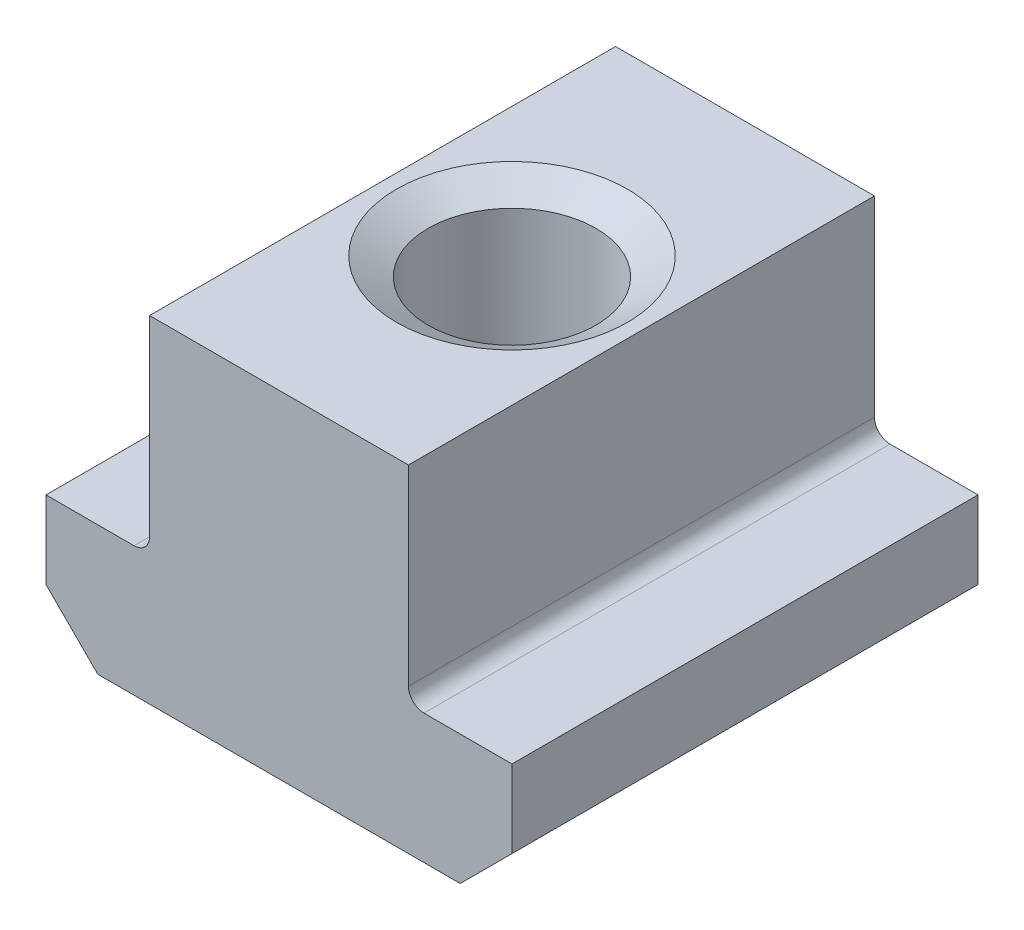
ISO-10303-21;
HEADER;
FILE_DESCRIPTION(('STEP AP214'),'2;1');
FILE_NAME('part.step','',(''),(''),'','','');
FILE_SCHEMA(('AUTOMOTIVE_DESIGN { 1 0 10303 214 1 1 1 1 }'));
ENDSEC;
DATA;
#1=APPLICATION_CONTEXT('core data for automotive mechanical design processes');
#2=APPLICATION_PROTOCOL_DEFINITION('international standard','automotive_design',2000,#1);
#3=PRODUCT_CONTEXT('',#1,'mechanical');
#4=PRODUCT('Part','Part','',(#3));
#5=PRODUCT_RELATED_PRODUCT_CATEGORY('part','',(#4));
#6=PRODUCT_DEFINITION_FORMATION('','',#4);
#7=PRODUCT_DEFINITION_CONTEXT('part definition',#1,'design');
#8=PRODUCT_DEFINITION('design','',#6,#7);
#9=PRODUCT_DEFINITION_SHAPE('','',#8);
#10=(LENGTH_UNIT() NAMED_UNIT(*) SI_UNIT(.MILLI.,.METRE.));
#11=(NAMED_UNIT(*) PLANE_ANGLE_UNIT() SI_UNIT($,.RADIAN.));
#12=(NAMED_UNIT(*) SI_UNIT($,.STERADIAN.) SOLID_ANGLE_UNIT());
#13=UNCERTAINTY_MEASURE_WITH_UNIT(LENGTH_MEASURE(1.E-05),#10,'distance_accuracy_value','');
#14=(GEOMETRIC_REPRESENTATION_CONTEXT(3) GLOBAL_UNCERTAINTY_ASSIGNED_CONTEXT((#13)) GLOBAL_UNIT_ASSIGNED_CONTEXT((#10,
#11,#12)) REPRESENTATION_CONTEXT('',''));
#15=CARTESIAN_POINT('',(0.,0.,0.));
#16=DIRECTION('',(0.,0.,1.));
#17=DIRECTION('',(1.,0.,0.));
#18=AXIS2_PLACEMENT_3D('',#15,#16,#17);
#19=CARTESIAN_POINT('',(-4.5,0.,-9.));
#20=DIRECTION('',(-1.,0.,0.));
#21=DIRECTION('',(0.,0.,1.));
#22=AXIS2_PLACEMENT_3D('',#19,#20,#21);
#23=PLANE('',#22);
#24=DIRECTION('',(0.,-1.,0.));
#25=VECTOR('',#24,1.);
#26=CARTESIAN_POINT('',(-4.5,0.,-9.));
#27=LINE('',#26,#25);
#28=CARTESIAN_POINT('',(-4.5,2.5,-9.));
#29=VERTEX_POINT('',#28);
#30=CARTESIAN_POINT('',(-4.5,1.00000000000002,-9.));
#31=VERTEX_POINT('',#30);
#32=EDGE_CURVE('E191',#29,#31,#27,.T.);
#33=ORIENTED_EDGE('',*,*,#32,.T.);
#34=DIRECTION('',(0.,0.,1.));
#35=VECTOR('',#34,1.);
#36=CARTESIAN_POINT('',(-4.5,1.00000000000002,-9.));
#37=LINE('',#36,#35);
#38=CARTESIAN_POINT('',(-4.5,1.00000000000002,0.));
#39=VERTEX_POINT('',#38);
#40=EDGE_CURVE('E218',#31,#39,#37,.T.);
#41=ORIENTED_EDGE('',*,*,#40,.T.);
#42=DIRECTION('',(0.,-1.,0.));
#43=VECTOR('',#42,1.);
#44=CARTESIAN_POINT('',(-4.5,0.,0.));
#45=LINE('',#44,#43);
#46=CARTESIAN_POINT('',(-4.5,2.5,0.));
#47=VERTEX_POINT('',#46);
#48=EDGE_CURVE('E164',#47,#39,#45,.T.);
#49=ORIENTED_EDGE('',*,*,#48,.F.);
#50=DIRECTION('',(0.,0.,1.));
#51=VECTOR('',#50,1.);
#52=CARTESIAN_POINT('',(-4.5,2.5,-9.));
#53=LINE('',#52,#51);
#54=EDGE_CURVE('E192',#29,#47,#53,.T.);
#55=ORIENTED_EDGE('',*,*,#54,.F.);
#56=EDGE_LOOP('',(#33,#41,#49,#55));
#57=FACE_BOUND('',#56,.T.);
#58=ADVANCED_FACE('F33',(#57),#23,.T.);
#59=CARTESIAN_POINT('',(-4.5,2.5,-9.));
#60=DIRECTION('',(0.,1.,0.));
#61=DIRECTION('',(-1.,0.,0.));
#62=AXIS2_PLACEMENT_3D('',#59,#60,#61);
#63=PLANE('',#62);
#64=DIRECTION('',(-1.,0.,0.));
#65=VECTOR('',#64,1.);
#66=CARTESIAN_POINT('',(-4.5,2.5,0.));
#67=LINE('',#66,#65);
#68=CARTESIAN_POINT('',(-2.8,2.5,0.));
#69=VERTEX_POINT('',#68);
#70=EDGE_CURVE('E188',#69,#47,#67,.T.);
#71=ORIENTED_EDGE('',*,*,#70,.F.);
#72=DIRECTION('',(0.,0.,1.));
#73=VECTOR('',#72,1.);
#74=CARTESIAN_POINT('',(-2.8,2.5,-9.));
#75=LINE('',#74,#73);
#76=CARTESIAN_POINT('',(-2.8,2.5,-9.));
#77=VERTEX_POINT('',#76);
#78=EDGE_CURVE('E195',#77,#69,#75,.T.);
#79=ORIENTED_EDGE('',*,*,#78,.F.);
#80=DIRECTION('',(-1.,0.,0.));
#81=VECTOR('',#80,1.);
#82=CARTESIAN_POINT('',(-4.5,2.5,-9.));
#83=LINE('',#82,#81);
#84=EDGE_CURVE('E139',#77,#29,#83,.T.);
#85=ORIENTED_EDGE('',*,*,#84,.T.);
#86=ORIENTED_EDGE('',*,*,#54,.T.);
#87=EDGE_LOOP('',(#71,#79,#85,#86));
#88=FACE_BOUND('',#87,.T.);
#89=ADVANCED_FACE('F267',(#88),#63,.T.);
#90=CARTESIAN_POINT('',(-2.8,2.8,-9.));
#91=DIRECTION('',(0.,0.,1.));
#92=DIRECTION('',(1.,0.,0.));
#93=AXIS2_PLACEMENT_3D('',#90,#91,#92);
#94=CYLINDRICAL_SURFACE('',#93,0.3);
#95=CARTESIAN_POINT('',(-2.8,2.8,0.));
#96=DIRECTION('',(0.,0.,-1.));
#97=DIRECTION('',(-1.,0.,0.));
#98=AXIS2_PLACEMENT_3D('',#95,#96,#97);
#99=CIRCLE('',#98,0.3);
#100=CARTESIAN_POINT('',(-2.5,2.8,0.));
#101=VERTEX_POINT('',#100);
#102=EDGE_CURVE('E185',#101,#69,#99,.T.);
#103=ORIENTED_EDGE('',*,*,#102,.F.);
#104=DIRECTION('',(0.,0.,1.));
#105=VECTOR('',#104,1.);
#106=CARTESIAN_POINT('',(-2.5,2.8,-9.));
#107=LINE('',#106,#105);
#108=CARTESIAN_POINT('',(-2.5,2.8,-9.));
#109=VERTEX_POINT('',#108);
#110=EDGE_CURVE('E197',#109,#101,#107,.T.);
#111=ORIENTED_EDGE('',*,*,#110,.F.);
#112=CARTESIAN_POINT('',(-2.8,2.8,-9.));
#113=DIRECTION('',(0.,0.,-1.));
#114=DIRECTION('',(-1.,0.,0.));
#115=AXIS2_PLACEMENT_3D('',#112,#113,#114);
#116=CIRCLE('',#115,0.3);
#117=EDGE_CURVE('E159',#109,#77,#116,.T.);
#118=ORIENTED_EDGE('',*,*,#117,.T.);
#119=ORIENTED_EDGE('',*,*,#78,.T.);
#120=EDGE_LOOP('',(#103,#111,#118,#119));
#121=FACE_BOUND('',#120,.T.);
#122=ADVANCED_FACE('F297',(#121),#94,.F.);
#123=CARTESIAN_POINT('',(-2.5,2.8,-9.));
#124=DIRECTION('',(-1.,0.,0.));
#125=DIRECTION('',(0.,0.,1.));
#126=AXIS2_PLACEMENT_3D('',#123,#124,#125);
#127=PLANE('',#126);
#128=DIRECTION('',(0.,-1.,0.));
#129=VECTOR('',#128,1.);
#130=CARTESIAN_POINT('',(-2.5,2.8,0.));
#131=LINE('',#130,#129);
#132=CARTESIAN_POINT('',(-2.5,6.5,0.));
#133=VERTEX_POINT('',#132);
#134=EDGE_CURVE('E182',#133,#101,#131,.T.);
#135=ORIENTED_EDGE('',*,*,#134,.F.);
#136=DIRECTION('',(0.,0.,1.));
#137=VECTOR('',#136,1.);
#138=CARTESIAN_POINT('',(-2.5,6.5,-9.));
#139=LINE('',#138,#137);
#140=CARTESIAN_POINT('',(-2.5,6.5,-9.));
#141=VERTEX_POINT('',#140);
#142=EDGE_CURVE('E199',#141,#133,#139,.T.);
#143=ORIENTED_EDGE('',*,*,#142,.F.);
#144=DIRECTION('',(0.,-1.,0.));
#145=VECTOR('',#144,1.);
#146=CARTESIAN_POINT('',(-2.5,2.8,-9.));
#147=LINE('',#146,#145);
#148=EDGE_CURVE('E156',#141,#109,#147,.T.);
#149=ORIENTED_EDGE('',*,*,#148,.T.);
#150=ORIENTED_EDGE('',*,*,#110,.T.);
#151=EDGE_LOOP('',(#135,#143,#149,#150));
#152=FACE_BOUND('',#151,.T.);
#153=ADVANCED_FACE('F276',(#152),#127,.T.);
#154=CARTESIAN_POINT('',(-2.5,6.5,-9.));
#155=DIRECTION('',(0.,1.,0.));
#156=DIRECTION('',(0.,0.,1.));
#157=AXIS2_PLACEMENT_3D('',#154,#155,#156);
#158=PLANE('',#157);
#159=CARTESIAN_POINT('',(0.,6.5,-4.5));
#160=DIRECTION('',(0.,1.,0.));
#161=DIRECTION('',(0.,0.,1.));
#162=AXIS2_PLACEMENT_3D('',#159,#160,#161);
#163=CIRCLE('',#162,2.22998906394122);
#164=CARTESIAN_POINT('',(0.,6.5,-2.27001093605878));
#165=VERTEX_POINT('',#164);
#166=EDGE_CURVE('E41',#165,#165,#163,.F.);
#167=ORIENTED_EDGE('',*,*,#166,.T.);
#168=EDGE_LOOP('',(#167));
#169=FACE_BOUND('',#168,.T.);
#170=DIRECTION('',(-1.,0.,0.));
#171=VECTOR('',#170,1.);
#172=CARTESIAN_POINT('',(-2.5,6.5,0.));
#173=LINE('',#172,#171);
#174=CARTESIAN_POINT('',(2.5,6.5,0.));
#175=VERTEX_POINT('',#174);
#176=EDGE_CURVE('E179',#175,#133,#173,.T.);
#177=ORIENTED_EDGE('',*,*,#176,.F.);
#178=DIRECTION('',(0.,0.,1.));
#179=VECTOR('',#178,1.);
#180=CARTESIAN_POINT('',(2.5,6.5,-9.));
#181=LINE('',#180,#179);
#182=CARTESIAN_POINT('',(2.5,6.5,-9.));
#183=VERTEX_POINT('',#182);
#184=EDGE_CURVE('E201',#183,#175,#181,.T.);
#185=ORIENTED_EDGE('',*,*,#184,.F.);
#186=DIRECTION('',(-1.,0.,0.));
#187=VECTOR('',#186,1.);
#188=CARTESIAN_POINT('',(-2.5,6.5,-9.));
#189=LINE('',#188,#187);
#190=EDGE_CURVE('E153',#183,#141,#189,.T.);
#191=ORIENTED_EDGE('',*,*,#190,.T.);
#192=ORIENTED_EDGE('',*,*,#142,.T.);
#193=EDGE_LOOP('',(#177,#185,#191,#192));
#194=FACE_BOUND('',#193,.T.);
#195=ADVANCED_FACE('F229',(#169,#194),#158,.T.);
#196=CARTESIAN_POINT('',(2.5,2.8,-9.));
#197=DIRECTION('',(1.,0.,0.));
#198=DIRECTION('',(0.,1.,0.));
#199=AXIS2_PLACEMENT_3D('',#196,#197,#198);
#200=PLANE('',#199);
#201=DIRECTION('',(0.,1.,0.));
#202=VECTOR('',#201,1.);
#203=CARTESIAN_POINT('',(2.5,2.8,0.));
#204=LINE('',#203,#202);
#205=CARTESIAN_POINT('',(2.5,2.8,0.));
#206=VERTEX_POINT('',#205);
#207=EDGE_CURVE('E176',#206,#175,#204,.T.);
#208=ORIENTED_EDGE('',*,*,#207,.F.);
#209=DIRECTION('',(0.,0.,1.));
#210=VECTOR('',#209,1.);
#211=CARTESIAN_POINT('',(2.5,2.8,-9.));
#212=LINE('',#211,#210);
#213=CARTESIAN_POINT('',(2.5,2.8,-9.));
#214=VERTEX_POINT('',#213);
#215=EDGE_CURVE('E203',#214,#206,#212,.T.);
#216=ORIENTED_EDGE('',*,*,#215,.F.);
#217=DIRECTION('',(0.,1.,0.));
#218=VECTOR('',#217,1.);
#219=CARTESIAN_POINT('',(2.5,2.8,-9.));
#220=LINE('',#219,#218);
#221=EDGE_CURVE('E147',#214,#183,#220,.T.);
#222=ORIENTED_EDGE('',*,*,#221,.T.);
#223=ORIENTED_EDGE('',*,*,#184,.T.);
#224=EDGE_LOOP('',(#208,#216,#222,#223));
#225=FACE_BOUND('',#224,.T.);
#226=ADVANCED_FACE('F280',(#225),#200,.T.);
#227=CARTESIAN_POINT('',(2.8,2.8,-9.));
#228=DIRECTION('',(0.,0.,1.));
#229=DIRECTION('',(1.,0.,0.));
#230=AXIS2_PLACEMENT_3D('',#227,#228,#229);
#231=CYLINDRICAL_SURFACE('',#230,0.3);
#232=CARTESIAN_POINT('',(2.8,2.8,0.));
#233=DIRECTION('',(0.,0.,-1.));
#234=DIRECTION('',(1.,0.,0.));
#235=AXIS2_PLACEMENT_3D('',#232,#233,#234);
#236=CIRCLE('',#235,0.3);
#237=CARTESIAN_POINT('',(2.8,2.5,0.));
#238=VERTEX_POINT('',#237);
#239=EDGE_CURVE('E173',#238,#206,#236,.T.);
#240=ORIENTED_EDGE('',*,*,#239,.F.);
#241=DIRECTION('',(0.,0.,1.));
#242=VECTOR('',#241,1.);
#243=CARTESIAN_POINT('',(2.8,2.5,-9.));
#244=LINE('',#243,#242);
#245=CARTESIAN_POINT('',(2.8,2.5,-9.));
#246=VERTEX_POINT('',#245);
#247=EDGE_CURVE('E138',#246,#238,#244,.T.);
#248=ORIENTED_EDGE('',*,*,#247,.F.);
#249=CARTESIAN_POINT('',(2.8,2.8,-9.));
#250=DIRECTION('',(0.,0.,-1.));
#251=DIRECTION('',(1.,0.,0.));
#252=AXIS2_PLACEMENT_3D('',#249,#250,#251);
#253=CIRCLE('',#252,0.3);
#254=EDGE_CURVE('E145',#246,#214,#253,.T.);
#255=ORIENTED_EDGE('',*,*,#254,.T.);
#256=ORIENTED_EDGE('',*,*,#215,.T.);
#257=EDGE_LOOP('',(#240,#248,#255,#256));
#258=FACE_BOUND('',#257,.T.);
#259=ADVANCED_FACE('F283',(#258),#231,.F.);
#260=CARTESIAN_POINT('',(2.8,2.5,-9.));
#261=DIRECTION('',(0.,1.,0.));
#262=DIRECTION('',(-1.,0.,0.));
#263=AXIS2_PLACEMENT_3D('',#260,#261,#262);
#264=PLANE('',#263);
#265=DIRECTION('',(-1.,0.,0.));
#266=VECTOR('',#265,1.);
#267=CARTESIAN_POINT('',(2.8,2.5,0.));
#268=LINE('',#267,#266);
#269=CARTESIAN_POINT('',(4.5,2.5,0.));
#270=VERTEX_POINT('',#269);
#271=EDGE_CURVE('E137',#270,#238,#268,.T.);
#272=ORIENTED_EDGE('',*,*,#271,.F.);
#273=DIRECTION('',(0.,0.,1.));
#274=VECTOR('',#273,1.);
#275=CARTESIAN_POINT('',(4.5,2.5,-9.));
#276=LINE('',#275,#274);
#277=CARTESIAN_POINT('',(4.5,2.5,-9.));
#278=VERTEX_POINT('',#277);
#279=EDGE_CURVE('E126',#278,#270,#276,.T.);
#280=ORIENTED_EDGE('',*,*,#279,.F.);
#281=DIRECTION('',(-1.,0.,0.));
#282=VECTOR('',#281,1.);
#283=CARTESIAN_POINT('',(2.8,2.5,-9.));
#284=LINE('',#283,#282);
#285=EDGE_CURVE('E130',#278,#246,#284,.T.);
#286=ORIENTED_EDGE('',*,*,#285,.T.);
#287=ORIENTED_EDGE('',*,*,#247,.T.);
#288=EDGE_LOOP('',(#272,#280,#286,#287));
#289=FACE_BOUND('',#288,.T.);
#290=ADVANCED_FACE('F135',(#289),#264,.T.);
#291=CARTESIAN_POINT('',(4.5,0.,-9.));
#292=DIRECTION('',(1.,0.,0.));
#293=DIRECTION('',(0.,1.,0.));
#294=AXIS2_PLACEMENT_3D('',#291,#292,#293);
#295=PLANE('',#294);
#296=DIRECTION('',(0.,1.,0.));
#297=VECTOR('',#296,1.);
#298=CARTESIAN_POINT('',(4.5,0.,0.));
#299=LINE('',#298,#297);
#300=CARTESIAN_POINT('',(4.5,1.00000000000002,0.));
#301=VERTEX_POINT('',#300);
#302=EDGE_CURVE('E170',#301,#270,#299,.T.);
#303=ORIENTED_EDGE('',*,*,#302,.F.);
#304=DIRECTION('',(0.,0.,-1.));
#305=VECTOR('',#304,1.);
#306=CARTESIAN_POINT('',(4.5,1.00000000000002,-9.));
#307=LINE('',#306,#305);
#308=CARTESIAN_POINT('',(4.5,1.00000000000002,-9.));
#309=VERTEX_POINT('',#308);
#310=EDGE_CURVE('E56',#301,#309,#307,.T.);
#311=ORIENTED_EDGE('',*,*,#310,.T.);
#312=DIRECTION('',(0.,1.,0.));
#313=VECTOR('',#312,1.);
#314=CARTESIAN_POINT('',(4.5,0.,-9.));
#315=LINE('',#314,#313);
#316=EDGE_CURVE('E123',#309,#278,#315,.T.);
#317=ORIENTED_EDGE('',*,*,#316,.T.);
#318=ORIENTED_EDGE('',*,*,#279,.T.);
#319=EDGE_LOOP('',(#303,#311,#317,#318));
#320=FACE_BOUND('',#319,.T.);
#321=ADVANCED_FACE('F125',(#320),#295,.T.);
#322=CARTESIAN_POINT('',(-4.5,0.,-9.));
#323=DIRECTION('',(0.,-1.,0.));
#324=DIRECTION('',(1.,0.,0.));
#325=AXIS2_PLACEMENT_3D('',#322,#323,#324);
#326=PLANE('',#325);
#327=CARTESIAN_POINT('',(0.,0.,-4.5));
#328=DIRECTION('',(0.,-1.,0.));
#329=DIRECTION('',(1.,0.,0.));
#330=AXIS2_PLACEMENT_3D('',#327,#328,#329);
#331=CIRCLE('',#330,2.22998906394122);
#332=CARTESIAN_POINT('',(2.22998906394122,0.,-4.5));
#333=VERTEX_POINT('',#332);
#334=EDGE_CURVE('E11',#333,#333,#331,.F.);
#335=ORIENTED_EDGE('',*,*,#334,.T.);
#336=EDGE_LOOP('',(#335));
#337=FACE_BOUND('',#336,.T.);
#338=DIRECTION('',(1.,0.,0.));
#339=VECTOR('',#338,1.);
#340=CARTESIAN_POINT('',(-4.5,0.,-9.));
#341=LINE('',#340,#339);
#342=CARTESIAN_POINT('',(-3.49999999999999,0.,-9.));
#343=VERTEX_POINT('',#342);
#344=CARTESIAN_POINT('',(3.49999999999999,0.,-9.));
#345=VERTEX_POINT('',#344);
#346=EDGE_CURVE('E131',#343,#345,#341,.T.);
#347=ORIENTED_EDGE('',*,*,#346,.T.);
#348=DIRECTION('',(0.,0.,1.));
#349=VECTOR('',#348,1.);
#350=CARTESIAN_POINT('',(3.49999999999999,0.,-9.));
#351=LINE('',#350,#349);
#352=CARTESIAN_POINT('',(3.49999999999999,0.,0.));
#353=VERTEX_POINT('',#352);
#354=EDGE_CURVE('E207',#345,#353,#351,.T.);
#355=ORIENTED_EDGE('',*,*,#354,.T.);
#356=DIRECTION('',(1.,0.,0.));
#357=VECTOR('',#356,1.);
#358=CARTESIAN_POINT('',(-4.5,0.,0.));
#359=LINE('',#358,#357);
#360=CARTESIAN_POINT('',(-3.49999999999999,0.,0.));
#361=VERTEX_POINT('',#360);
#362=EDGE_CURVE('E167',#361,#353,#359,.T.);
#363=ORIENTED_EDGE('',*,*,#362,.F.);
#364=DIRECTION('',(0.,0.,-1.));
#365=VECTOR('',#364,1.);
#366=CARTESIAN_POINT('',(-3.49999999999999,0.,-9.));
#367=LINE('',#366,#365);
#368=EDGE_CURVE('E194',#361,#343,#367,.T.);
#369=ORIENTED_EDGE('',*,*,#368,.T.);
#370=EDGE_LOOP('',(#347,#355,#363,#369));
#371=FACE_BOUND('',#370,.T.);
#372=ADVANCED_FACE('F248',(#337,#371),#326,.T.);
#373=CARTESIAN_POINT('',(-2.8,2.8,-9.));
#374=DIRECTION('',(0.,0.,-1.));
#375=DIRECTION('',(-1.,0.,0.));
#376=AXIS2_PLACEMENT_3D('',#373,#374,#375);
#377=PLANE('',#376);
#378=ORIENTED_EDGE('',*,*,#316,.F.);
#379=DIRECTION('',(0.707106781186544,0.707106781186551,0.));
#380=VECTOR('',#379,1.);
#381=CARTESIAN_POINT('',(1.75000000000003,-1.74999999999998,-9.));
#382=LINE('',#381,#380);
#383=EDGE_CURVE('E216',#309,#345,#382,.F.);
#384=ORIENTED_EDGE('',*,*,#383,.T.);
#385=ORIENTED_EDGE('',*,*,#346,.F.);
#386=DIRECTION('',(0.707106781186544,-0.707106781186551,0.));
#387=VECTOR('',#386,1.);
#388=CARTESIAN_POINT('',(-4.55,1.05000000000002,-9.));
#389=LINE('',#388,#387);
#390=EDGE_CURVE('E48',#343,#31,#389,.F.);
#391=ORIENTED_EDGE('',*,*,#390,.T.);
#392=ORIENTED_EDGE('',*,*,#32,.F.);
#393=ORIENTED_EDGE('',*,*,#84,.F.);
#394=ORIENTED_EDGE('',*,*,#117,.F.);
#395=ORIENTED_EDGE('',*,*,#148,.F.);
#396=ORIENTED_EDGE('',*,*,#190,.F.);
#397=ORIENTED_EDGE('',*,*,#221,.F.);
#398=ORIENTED_EDGE('',*,*,#254,.F.);
#399=ORIENTED_EDGE('',*,*,#285,.F.);
#400=EDGE_LOOP('',(#378,#384,#385,#391,#392,#393,#394,#395,#396,#397,#398,#399));
#401=FACE_BOUND('',#400,.T.);
#402=ADVANCED_FACE('F142',(#401),#377,.T.);
#403=CARTESIAN_POINT('',(-2.8,2.8,0.));
#404=DIRECTION('',(0.,0.,-1.));
#405=DIRECTION('',(-1.,0.,0.));
#406=AXIS2_PLACEMENT_3D('',#403,#404,#405);
#407=PLANE('',#406);
#408=ORIENTED_EDGE('',*,*,#362,.T.);
#409=DIRECTION('',(-0.707106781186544,-0.707106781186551,0.));
#410=VECTOR('',#409,1.);
#411=CARTESIAN_POINT('',(3.49999999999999,0.,0.));
#412=LINE('',#411,#410);
#413=EDGE_CURVE('E212',#353,#301,#412,.F.);
#414=ORIENTED_EDGE('',*,*,#413,.T.);
#415=ORIENTED_EDGE('',*,*,#302,.T.);
#416=ORIENTED_EDGE('',*,*,#271,.T.);
#417=ORIENTED_EDGE('',*,*,#239,.T.);
#418=ORIENTED_EDGE('',*,*,#207,.T.);
#419=ORIENTED_EDGE('',*,*,#176,.T.);
#420=ORIENTED_EDGE('',*,*,#134,.T.);
#421=ORIENTED_EDGE('',*,*,#102,.T.);
#422=ORIENTED_EDGE('',*,*,#70,.T.);
#423=ORIENTED_EDGE('',*,*,#48,.T.);
#424=DIRECTION('',(-0.707106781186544,0.707106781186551,0.));
#425=VECTOR('',#424,1.);
#426=CARTESIAN_POINT('',(-4.5,1.00000000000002,0.));
#427=LINE('',#426,#425);
#428=EDGE_CURVE('E210',#39,#361,#427,.F.);
#429=ORIENTED_EDGE('',*,*,#428,.T.);
#430=EDGE_LOOP('',(#408,#414,#415,#416,#417,#418,#419,#420,#421,#422,#423,#429));
#431=FACE_BOUND('',#430,.T.);
#432=ADVANCED_FACE('F259',(#431),#407,.F.);
#433=CARTESIAN_POINT('',(3.49999999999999,0.,-9.));
#434=DIRECTION('',(-0.707106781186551,0.707106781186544,0.));
#435=DIRECTION('',(-0.707106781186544,-0.707106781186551,0.));
#436=AXIS2_PLACEMENT_3D('',#433,#434,#435);
#437=PLANE('',#436);
#438=ORIENTED_EDGE('',*,*,#383,.F.);
#439=ORIENTED_EDGE('',*,*,#310,.F.);
#440=ORIENTED_EDGE('',*,*,#413,.F.);
#441=ORIENTED_EDGE('',*,*,#354,.F.);
#442=EDGE_LOOP('',(#438,#439,#440,#441));
#443=FACE_BOUND('',#442,.T.);
#444=ADVANCED_FACE('F257',(#443),#437,.F.);
#445=CARTESIAN_POINT('',(-4.5,1.00000000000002,-9.));
#446=DIRECTION('',(0.707106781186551,0.707106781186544,0.));
#447=DIRECTION('',(-0.707106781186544,0.707106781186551,0.));
#448=AXIS2_PLACEMENT_3D('',#445,#446,#447);
#449=PLANE('',#448);
#450=ORIENTED_EDGE('',*,*,#390,.F.);
#451=ORIENTED_EDGE('',*,*,#368,.F.);
#452=ORIENTED_EDGE('',*,*,#428,.F.);
#453=ORIENTED_EDGE('',*,*,#40,.F.);
#454=EDGE_LOOP('',(#450,#451,#452,#453));
#455=FACE_BOUND('',#454,.T.);
#456=ADVANCED_FACE('F240',(#455),#449,.F.);
#457=CARTESIAN_POINT('',(0.,0.,-4.5));
#458=DIRECTION('',(0.,1.,0.));
#459=DIRECTION('',(-1.,0.,0.));
#460=AXIS2_PLACEMENT_3D('',#457,#458,#459);
#461=CYLINDRICAL_SURFACE('',#460,1.621);
#462=CARTESIAN_POINT('',(0.,6.1484,-4.5));
#463=DIRECTION('',(0.,1.,0.));
#464=DIRECTION('',(-1.,0.,0.));
#465=AXIS2_PLACEMENT_3D('',#462,#463,#464);
#466=CIRCLE('',#465,1.621);
#467=CARTESIAN_POINT('',(-1.621,6.1484,-4.5));
#468=VERTEX_POINT('',#467);
#469=EDGE_CURVE('E224',#468,#468,#466,.T.);
#470=ORIENTED_EDGE('',*,*,#469,.T.);
#471=EDGE_LOOP('',(#470));
#472=FACE_BOUND('',#471,.T.);
#473=CARTESIAN_POINT('',(0.,0.351600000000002,-4.5));
#474=DIRECTION('',(0.,-1.,0.));
#475=DIRECTION('',(1.,0.,0.));
#476=AXIS2_PLACEMENT_3D('',#473,#474,#475);
#477=CIRCLE('',#476,1.621);
#478=CARTESIAN_POINT('',(1.621,0.351600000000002,-4.5));
#479=VERTEX_POINT('',#478);
#480=EDGE_CURVE('E221',#479,#479,#477,.T.);
#481=ORIENTED_EDGE('',*,*,#480,.T.);
#482=EDGE_LOOP('',(#481));
#483=FACE_BOUND('',#482,.T.);
#484=ADVANCED_FACE('F235',(#472,#483),#461,.F.);
#485=CARTESIAN_POINT('',(0.,6.1484,-4.5));
#486=DIRECTION('',(0.,1.,0.));
#487=DIRECTION('',(-1.,0.,0.));
#488=AXIS2_PLACEMENT_3D('',#485,#486,#487);
#489=CONICAL_SURFACE('',#488,1.621,1.0471975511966);
#490=ORIENTED_EDGE('',*,*,#166,.F.);
#491=EDGE_LOOP('',(#490));
#492=FACE_BOUND('',#491,.T.);
#493=ORIENTED_EDGE('',*,*,#469,.F.);
#494=EDGE_LOOP('',(#493));
#495=FACE_BOUND('',#494,.T.);
#496=ADVANCED_FACE('F232',(#492,#495),#489,.F.);
#497=CARTESIAN_POINT('',(0.,0.,-4.5));
#498=DIRECTION('',(0.,-1.,0.));
#499=DIRECTION('',(1.,0.,0.));
#500=AXIS2_PLACEMENT_3D('',#497,#498,#499);
#501=CONICAL_SURFACE('',#500,2.22998906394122,1.04719755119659);
#502=ORIENTED_EDGE('',*,*,#480,.F.);
#503=EDGE_LOOP('',(#502));
#504=FACE_BOUND('',#503,.T.);
#505=ORIENTED_EDGE('',*,*,#334,.F.);
#506=EDGE_LOOP('',(#505));
#507=FACE_BOUND('',#506,.T.);
#508=ADVANCED_FACE('F35',(#504,#507),#501,.F.);
#509=CLOSED_SHELL('',(#58,#89,#122,#153,#195,#226,#259,#290,#321,#372,#402,#432,#444,#456,#484,
#496,#508));
#510=MANIFOLD_SOLID_BREP('B2',#509);
#511=ADVANCED_BREP_SHAPE_REPRESENTATION('',(#18,#510),#14);
#512=SHAPE_DEFINITION_REPRESENTATION(#9,#511);
ENDSEC;
END-ISO-10303-21;
